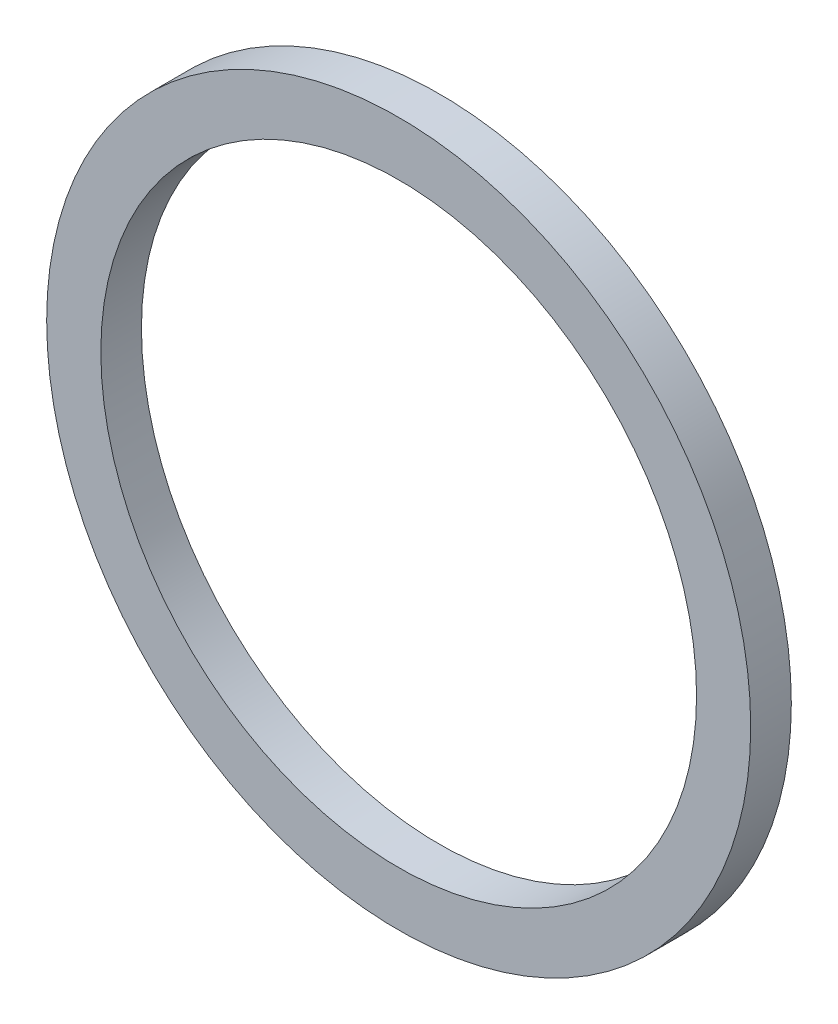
from build123d import *

# Parameters (mm, degrees)
ESQUISSE1_R      = 13
ESQUISSE1_R_2    = 11
EXTRUSION1_DEPTH = 1.5


with BuildPart() as part:
    # Esquisse1 → Extrusion1 (new body)
    with BuildSketch(Plane.XY):
        Circle(ESQUISSE1_R)
        Circle(ESQUISSE1_R_2, mode=Mode.SUBTRACT)
    extrude(amount=EXTRUSION1_DEPTH)


solid = part.part
